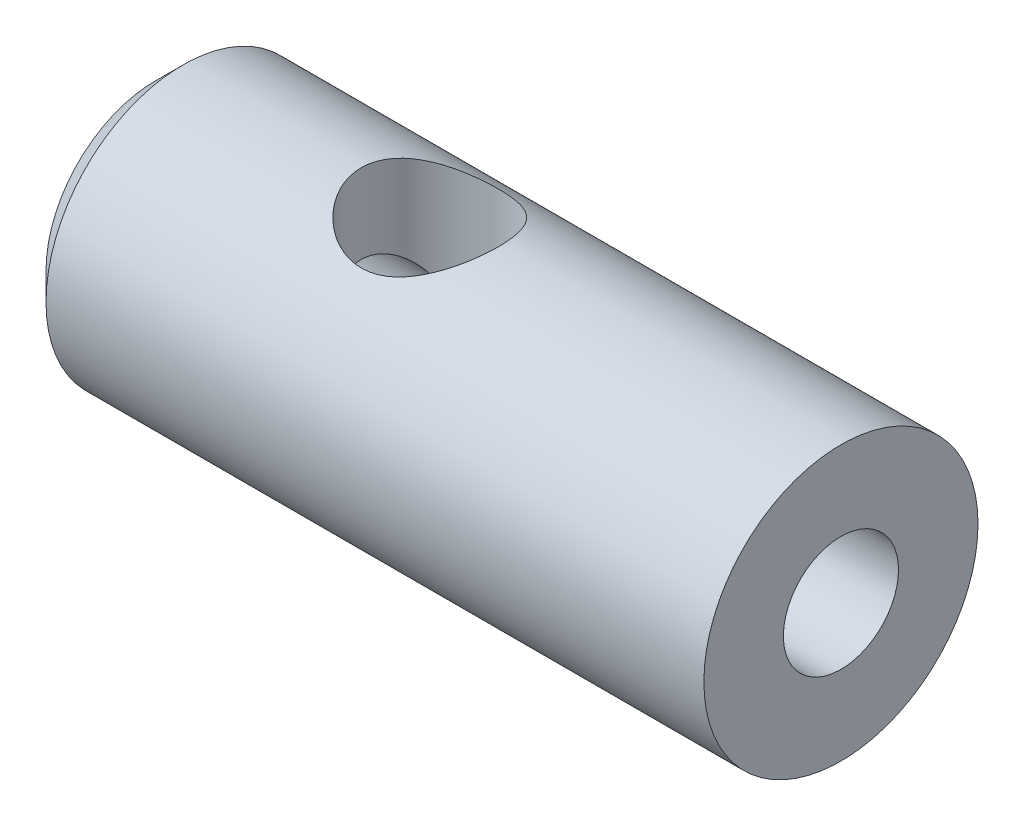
ISO-10303-21;
HEADER;
FILE_DESCRIPTION(('STEP AP214'),'2;1');
FILE_NAME('part.step','',(''),(''),'','','');
FILE_SCHEMA(('AUTOMOTIVE_DESIGN { 1 0 10303 214 1 1 1 1 }'));
ENDSEC;
DATA;
#1=APPLICATION_CONTEXT('core data for automotive mechanical design processes');
#2=APPLICATION_PROTOCOL_DEFINITION('international standard','automotive_design',2000,#1);
#3=PRODUCT_CONTEXT('',#1,'mechanical');
#4=PRODUCT('Part','Part','',(#3));
#5=PRODUCT_RELATED_PRODUCT_CATEGORY('part','',(#4));
#6=PRODUCT_DEFINITION_FORMATION('','',#4);
#7=PRODUCT_DEFINITION_CONTEXT('part definition',#1,'design');
#8=PRODUCT_DEFINITION('design','',#6,#7);
#9=PRODUCT_DEFINITION_SHAPE('','',#8);
#10=(LENGTH_UNIT() NAMED_UNIT(*) SI_UNIT(.MILLI.,.METRE.));
#11=(NAMED_UNIT(*) PLANE_ANGLE_UNIT() SI_UNIT($,.RADIAN.));
#12=(NAMED_UNIT(*) SI_UNIT($,.STERADIAN.) SOLID_ANGLE_UNIT());
#13=UNCERTAINTY_MEASURE_WITH_UNIT(LENGTH_MEASURE(1.E-05),#10,'distance_accuracy_value','');
#14=(GEOMETRIC_REPRESENTATION_CONTEXT(3) GLOBAL_UNCERTAINTY_ASSIGNED_CONTEXT((#13)) GLOBAL_UNIT_ASSIGNED_CONTEXT((#10,
#11,#12)) REPRESENTATION_CONTEXT('',''));
#15=CARTESIAN_POINT('',(0.,0.,0.));
#16=DIRECTION('',(0.,0.,1.));
#17=DIRECTION('',(1.,0.,0.));
#18=AXIS2_PLACEMENT_3D('',#15,#16,#17);
#19=CARTESIAN_POINT('',(0.,5.,0.));
#20=DIRECTION('',(-1.,0.,0.));
#21=DIRECTION('',(0.,0.,1.));
#22=AXIS2_PLACEMENT_3D('',#19,#20,#21);
#23=CYLINDRICAL_SURFACE('',#22,5.);
#24=CARTESIAN_POINT('',(1.,5.,0.));
#25=DIRECTION('',(-1.,0.,0.));
#26=DIRECTION('',(0.,0.,1.));
#27=AXIS2_PLACEMENT_3D('',#24,#25,#26);
#28=CIRCLE('',#27,5.);
#29=CARTESIAN_POINT('',(1.,5.,5.));
#30=VERTEX_POINT('',#29);
#31=EDGE_CURVE('E10',#30,#30,#28,.F.);
#32=ORIENTED_EDGE('',*,*,#31,.T.);
#33=EDGE_LOOP('',(#32));
#34=FACE_BOUND('',#33,.T.);
#35=CARTESIAN_POINT('',(25.,5.,0.));
#36=DIRECTION('',(-1.,0.,0.));
#37=DIRECTION('',(0.,0.,1.));
#38=AXIS2_PLACEMENT_3D('',#35,#36,#37);
#39=CIRCLE('',#38,5.);
#40=CARTESIAN_POINT('',(25.,5.,5.));
#41=VERTEX_POINT('',#40);
#42=EDGE_CURVE('E40',#41,#41,#39,.T.);
#43=ORIENTED_EDGE('',*,*,#42,.T.);
#44=EDGE_LOOP('',(#43));
#45=FACE_BOUND('',#44,.T.);
#46=CARTESIAN_POINT('',(10.,0.669872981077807,-2.5));
#47=CARTESIAN_POINT('',(9.86973349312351,0.669860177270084,-2.49998948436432));
#48=CARTESIAN_POINT('',(9.73929727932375,0.66390458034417,-2.48974954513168));
#49=CARTESIAN_POINT('',(9.48243102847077,0.640941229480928,-2.44930840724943));
#50=CARTESIAN_POINT('',(9.35600999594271,0.623910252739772,-2.41906526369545));
#51=CARTESIAN_POINT('',(9.11137105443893,0.581266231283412,-2.3402497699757));
#52=CARTESIAN_POINT('',(8.99311342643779,0.555698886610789,-2.29177485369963));
#53=CARTESIAN_POINT('',(8.76643943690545,0.498933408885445,-2.17816884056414));
#54=CARTESIAN_POINT('',(8.65802360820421,0.467734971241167,-2.11303684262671));
#55=CARTESIAN_POINT('',(8.44423569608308,0.400078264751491,-1.96166634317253));
#56=CARTESIAN_POINT('',(8.33985216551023,0.363398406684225,-1.87413008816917));
#57=CARTESIAN_POINT('',(8.1464790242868,0.290700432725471,-1.68313452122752));
#58=CARTESIAN_POINT('',(8.05749709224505,0.254682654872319,-1.57966731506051));
#59=CARTESIAN_POINT('',(7.89158212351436,0.184463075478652,-1.35122390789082));
#60=CARTESIAN_POINT('',(7.81586558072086,0.150547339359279,-1.22526797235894));
#61=CARTESIAN_POINT('',(7.68714786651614,0.0912310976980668,-0.960392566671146));
#62=CARTESIAN_POINT('',(7.6341323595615,0.0658252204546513,-0.821481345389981));
#63=CARTESIAN_POINT('',(7.55623834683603,0.0279884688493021,-0.545112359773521));
#64=CARTESIAN_POINT('',(7.52962618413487,0.0147629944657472,-0.408254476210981));
#65=CARTESIAN_POINT('',(7.49958470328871,-0.000189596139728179,-0.131426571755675));
#66=CARTESIAN_POINT('',(7.49614135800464,-0.00192366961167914,0.00854151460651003));
#67=CARTESIAN_POINT('',(7.51186668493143,0.00592545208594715,0.274581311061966));
#68=CARTESIAN_POINT('',(7.52909503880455,0.0145376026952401,0.400802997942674));
#69=CARTESIAN_POINT('',(7.58220210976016,0.0406438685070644,0.648284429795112));
#70=CARTESIAN_POINT('',(7.61808222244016,0.0581386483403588,0.769543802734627));
#71=CARTESIAN_POINT('',(7.70770641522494,0.100710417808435,1.00577347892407));
#72=CARTESIAN_POINT('',(7.76169078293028,0.125888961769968,1.120633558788));
#73=CARTESIAN_POINT('',(7.88565854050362,0.181558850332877,1.33994200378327));
#74=CARTESIAN_POINT('',(7.95564765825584,0.212052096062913,1.4443866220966));
#75=CARTESIAN_POINT('',(8.11723837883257,0.278890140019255,1.6504341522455));
#76=CARTESIAN_POINT('',(8.21025757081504,0.315515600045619,1.75083518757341));
#77=CARTESIAN_POINT('',(8.41147431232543,0.388641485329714,1.93526092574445));
#78=CARTESIAN_POINT('',(8.51968343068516,0.425141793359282,2.01927302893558));
#79=CARTESIAN_POINT('',(8.75662048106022,0.496396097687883,2.17376333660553));
#80=CARTESIAN_POINT('',(8.88621505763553,0.530892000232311,2.24304328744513));
#81=CARTESIAN_POINT('',(9.1573441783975,0.590613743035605,2.35829778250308));
#82=CARTESIAN_POINT('',(9.29886608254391,0.615849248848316,2.40429664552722));
#83=CARTESIAN_POINT('',(9.57803627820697,0.651384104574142,2.4679505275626));
#84=CARTESIAN_POINT('',(9.71510279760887,0.662708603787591,2.48756280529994));
#85=CARTESIAN_POINT('',(9.99100335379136,0.672052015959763,2.50379236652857));
#86=CARTESIAN_POINT('',(10.1298360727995,0.67008032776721,2.50042589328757));
#87=CARTESIAN_POINT('',(10.3891347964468,0.654141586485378,2.47259010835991));
#88=CARTESIAN_POINT('',(10.5099486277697,0.641510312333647,2.45046954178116));
#89=CARTESIAN_POINT('',(10.7459194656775,0.607649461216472,2.38924071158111));
#90=CARTESIAN_POINT('',(10.8610746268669,0.586417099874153,2.35012694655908));
#91=CARTESIAN_POINT('',(11.0885283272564,0.536594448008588,2.25411897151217));
#92=CARTESIAN_POINT('',(11.2004475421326,0.507708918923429,2.19648515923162));
#93=CARTESIAN_POINT('',(11.4136731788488,0.446097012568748,2.06571766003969));
#94=CARTESIAN_POINT('',(11.5149741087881,0.413368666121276,1.99257601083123));
#95=CARTESIAN_POINT('',(11.7174469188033,0.342800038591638,1.82209291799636));
#96=CARTESIAN_POINT('',(11.8169928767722,0.304835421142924,1.72286318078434));
#97=CARTESIAN_POINT('',(11.9985305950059,0.231644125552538,1.50851123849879));
#98=CARTESIAN_POINT('',(12.0805164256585,0.196418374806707,1.39338368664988));
#99=CARTESIAN_POINT('',(12.2264343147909,0.131465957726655,1.14633840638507));
#100=CARTESIAN_POINT('',(12.2898327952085,0.10190895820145,1.01405774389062));
#101=CARTESIAN_POINT('',(12.392844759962,0.0529161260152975,0.738805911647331));
#102=CARTESIAN_POINT('',(12.4324791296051,0.0334714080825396,0.595844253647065));
#103=CARTESIAN_POINT('',(12.4834214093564,0.00831229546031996,0.317449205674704));
#104=CARTESIAN_POINT('',(12.4969946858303,0.00150180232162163,0.182528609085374));
#105=CARTESIAN_POINT('',(12.5021081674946,-0.00105325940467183,-0.0878149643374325));
#106=CARTESIAN_POINT('',(12.4936560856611,0.00319829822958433,-0.223237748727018));
#107=CARTESIAN_POINT('',(12.4564589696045,0.0216507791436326,-0.481344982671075));
#108=CARTESIAN_POINT('',(12.4290878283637,0.0351776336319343,-0.604280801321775));
#109=CARTESIAN_POINT('',(12.3566825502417,0.0701976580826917,-0.843614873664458));
#110=CARTESIAN_POINT('',(12.3116458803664,0.0916919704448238,-0.960012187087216));
#111=CARTESIAN_POINT('',(12.2031821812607,0.141851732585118,-1.18855854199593));
#112=CARTESIAN_POINT('',(12.1390509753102,0.170784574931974,-1.30031295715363));
#113=CARTESIAN_POINT('',(11.9951058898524,0.232796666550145,-1.51193650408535));
#114=CARTESIAN_POINT('',(11.9152848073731,0.265877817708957,-1.61180014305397));
#115=CARTESIAN_POINT('',(11.7330042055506,0.336784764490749,-1.8072854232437));
#116=CARTESIAN_POINT('',(11.6290822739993,0.374755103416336,-1.90149582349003));
#117=CARTESIAN_POINT('',(11.4063847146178,0.448423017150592,-2.07165660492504));
#118=CARTESIAN_POINT('',(11.2875960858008,0.484118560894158,-2.1475908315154));
#119=CARTESIAN_POINT('',(11.0333638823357,0.55001017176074,-2.28108393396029));
#120=CARTESIAN_POINT('',(10.8975126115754,0.579996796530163,-2.3379862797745));
#121=CARTESIAN_POINT('',(10.6867773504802,0.616297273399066,-2.40494911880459));
#122=CARTESIAN_POINT('',(10.6154402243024,0.626945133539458,-2.42419582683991));
#123=CARTESIAN_POINT('',(10.4709593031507,0.644924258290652,-2.45635087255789));
#124=CARTESIAN_POINT('',(10.3978168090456,0.652257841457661,-2.46926364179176));
#125=CARTESIAN_POINT('',(10.2704990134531,0.661762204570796,-2.48591166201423));
#126=CARTESIAN_POINT('',(10.2165836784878,0.664795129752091,-2.49118864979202));
#127=CARTESIAN_POINT('',(10.1084553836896,0.668853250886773,-2.49823512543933));
#128=CARTESIAN_POINT('',(10.0542424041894,0.669878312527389,-2.50000437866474));
#129=CARTESIAN_POINT('',(10.,0.669872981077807,-2.5));
#130=B_SPLINE_CURVE_WITH_KNOTS('',3,(#46,#47,#48,#49,#50,#51,#52,#53,#54,#55,#56,#57,#58,#59,
#60,#61,#62,#63,#64,#65,#66,#67,#68,#69,#70,#71,#72,#73,#74,#75,#76,#77,#78,#79,#80,#81,#82,#83,
#84,#85,#86,#87,#88,#89,#90,#91,#92,#93,#94,#95,#96,#97,#98,#99,#100,#101,#102,#103,#104,#105,
#106,#107,#108,#109,#110,#111,#112,#113,#114,#115,#116,#117,#118,#119,#120,#121,#122,#123,#124,
#125,#126,#127,#128,#129),.UNSPECIFIED.,.T.,.F.,(4,2,2,2,2,2,2,2,2,2,2,2,2,2,2,2,2,2,2,2,2,2,2,
2,2,2,2,2,2,2,2,2,2,2,2,2,2,2,2,2,2,4),(0.,0.39058030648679,0.781982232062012,1.17132148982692,
1.56068181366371,1.98215578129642,2.40383927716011,2.85394730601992,3.30377067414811,
3.72158712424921,4.13915059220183,4.52040243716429,4.90168281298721,5.2882383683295,
5.67493248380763,6.0981797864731,6.5217512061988,6.97222104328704,7.42221935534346,
7.83655727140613,8.25060232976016,8.61935458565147,8.98822631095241,9.37418241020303,
9.76033715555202,10.1951685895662,10.6301466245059,11.076604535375,11.5226694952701,
11.927806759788,12.3328021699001,12.7111106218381,13.0894733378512,13.4840187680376,
13.8787457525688,14.3127560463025,14.7471485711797,15.195268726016,15.4189244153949,
15.6424233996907,15.8050484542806,15.9676843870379),.UNSPECIFIED.);
#131=CARTESIAN_POINT('',(10.,0.669872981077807,-2.5));
#132=VERTEX_POINT('',#131);
#133=EDGE_CURVE('E54',#132,#132,#130,.T.);
#134=ORIENTED_EDGE('',*,*,#133,.T.);
#135=EDGE_LOOP('',(#134));
#136=FACE_BOUND('',#135,.T.);
#137=CARTESIAN_POINT('',(7.5,10.,0.));
#138=CARTESIAN_POINT('',(7.50000966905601,9.99999177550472,-0.131426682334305));
#139=CARTESIAN_POINT('',(7.51042556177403,9.99476199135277,-0.263015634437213));
#140=CARTESIAN_POINT('',(7.55163182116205,9.9743541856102,-0.522301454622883));
#141=CARTESIAN_POINT('',(7.58246088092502,9.9591572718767,-0.649990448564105));
#142=CARTESIAN_POINT('',(7.66298462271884,9.92040690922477,-0.897333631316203));
#143=CARTESIAN_POINT('',(7.71260598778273,9.89688595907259,-1.01701694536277));
#144=CARTESIAN_POINT('',(7.8289265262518,9.84364443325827,-1.24618160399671));
#145=CARTESIAN_POINT('',(7.89562435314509,9.81392434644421,-1.3556637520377));
#146=CARTESIAN_POINT('',(8.04879313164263,9.74890645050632,-1.56876952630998));
#147=CARTESIAN_POINT('',(8.13621620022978,9.71337997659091,-1.67163802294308));
#148=CARTESIAN_POINT('',(8.32630369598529,9.64149925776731,-1.86194861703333));
#149=CARTESIAN_POINT('',(8.42897962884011,9.60514440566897,-1.94937895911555));
#150=CARTESIAN_POINT('',(8.65620837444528,9.53247377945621,-2.11312999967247));
#151=CARTESIAN_POINT('',(8.78184024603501,9.49637967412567,-2.18806333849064));
#152=CARTESIAN_POINT('',(9.04591833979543,9.43214946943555,-2.31542056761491));
#153=CARTESIAN_POINT('',(9.18435532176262,9.40400769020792,-2.36786053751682));
#154=CARTESIAN_POINT('',(9.46166276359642,9.36144667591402,-2.44533110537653));
#155=CARTESIAN_POINT('',(9.60001113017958,9.34630678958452,-2.47181464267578));
#156=CARTESIAN_POINT('',(9.87994709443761,9.3295472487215,-2.50106748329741));
#157=CARTESIAN_POINT('',(10.0215313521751,9.3279142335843,-2.50386022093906));
#158=CARTESIAN_POINT('',(10.2857150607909,9.33777325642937,-2.48671821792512));
#159=CARTESIAN_POINT('',(10.4085600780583,9.34771909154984,-2.46946139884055));
#160=CARTESIAN_POINT('',(10.6493047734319,9.37690571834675,-2.41734962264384));
#161=CARTESIAN_POINT('',(10.7672028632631,9.39614947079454,-2.38248905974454));
#162=CARTESIAN_POINT('',(10.9980728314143,9.44218691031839,-2.29552445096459));
#163=CARTESIAN_POINT('',(11.1108659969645,9.46914601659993,-2.24303766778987));
#164=CARTESIAN_POINT('',(11.326585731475,9.52758510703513,-2.12260421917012));
#165=CARTESIAN_POINT('',(11.4295078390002,9.55906711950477,-2.0546506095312));
#166=CARTESIAN_POINT('',(11.6363031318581,9.62782894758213,-1.89516513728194));
#167=CARTESIAN_POINT('',(11.7386421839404,9.66533775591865,-1.8017361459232));
#168=CARTESIAN_POINT('',(11.9268385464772,9.73869058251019,-1.59888894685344));
#169=CARTESIAN_POINT('',(12.0126879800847,9.77453379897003,-1.48946314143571));
#170=CARTESIAN_POINT('',(12.1692141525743,9.84254968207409,-1.25129126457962));
#171=CARTESIAN_POINT('',(12.2390011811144,9.87447460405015,-1.12188397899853));
#172=CARTESIAN_POINT('',(12.3552425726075,9.92894702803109,-0.851165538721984));
#173=CARTESIAN_POINT('',(12.4017154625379,9.95150197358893,-0.709863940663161));
#174=CARTESIAN_POINT('',(12.4661885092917,9.98310834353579,-0.431916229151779));
#175=CARTESIAN_POINT('',(12.486228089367,9.9931234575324,-0.295853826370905));
#176=CARTESIAN_POINT('',(12.5036618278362,10.0018253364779,-0.0219489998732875));
#177=CARTESIAN_POINT('',(12.5010667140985,10.0005174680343,0.11589254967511));
#178=CARTESIAN_POINT('',(12.4744832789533,9.98727980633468,0.378082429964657));
#179=CARTESIAN_POINT('',(12.4521686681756,9.97618114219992,0.502648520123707));
#180=CARTESIAN_POINT('',(12.3894048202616,9.94555428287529,0.746017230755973));
#181=CARTESIAN_POINT('',(12.3489535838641,9.92602515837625,0.864819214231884));
#182=CARTESIAN_POINT('',(12.2500038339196,9.87960628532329,1.09722152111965));
#183=CARTESIAN_POINT('',(12.1910223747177,9.85252204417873,1.21057599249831));
#184=CARTESIAN_POINT('',(12.0572311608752,9.7935993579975,1.42615340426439));
#185=CARTESIAN_POINT('',(11.9824146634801,9.76175888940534,1.52837157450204));
#186=CARTESIAN_POINT('',(11.8105989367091,9.69270553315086,1.72941922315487));
#187=CARTESIAN_POINT('',(11.7121428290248,9.65527212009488,1.82693019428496));
#188=CARTESIAN_POINT('',(11.5001871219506,9.58155978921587,2.0046408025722));
#189=CARTESIAN_POINT('',(11.3866772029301,9.54528168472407,2.08482846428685));
#190=CARTESIAN_POINT('',(11.1408908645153,9.4762798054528,2.22926978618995));
#191=CARTESIAN_POINT('',(11.0079718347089,9.44381323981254,2.29256373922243));
#192=CARTESIAN_POINT('',(10.7312248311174,9.38935180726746,2.39520706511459));
#193=CARTESIAN_POINT('',(10.587411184,9.36734345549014,2.43458729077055));
#194=CARTESIAN_POINT('',(10.3077244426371,9.33903752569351,2.48465421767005));
#195=CARTESIAN_POINT('',(10.172414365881,9.33143458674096,2.4977324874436));
#196=CARTESIAN_POINT('',(9.90138233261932,9.32913386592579,2.50172288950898));
#197=CARTESIAN_POINT('',(9.76566058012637,9.3344304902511,2.49264462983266));
#198=CARTESIAN_POINT('',(9.51129124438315,9.35594655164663,2.45481530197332));
#199=CARTESIAN_POINT('',(9.39224881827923,9.37107736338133,2.42802074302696));
#200=CARTESIAN_POINT('',(9.16047970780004,9.40927540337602,2.35793843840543));
#201=CARTESIAN_POINT('',(9.04775506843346,9.43234518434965,2.31464538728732));
#202=CARTESIAN_POINT('',(8.82343784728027,9.48571326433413,2.20953919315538));
#203=CARTESIAN_POINT('',(8.71243014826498,9.5163930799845,2.14667719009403));
#204=CARTESIAN_POINT('',(8.50181375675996,9.58088327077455,2.0053780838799));
#205=CARTESIAN_POINT('',(8.40221103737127,9.61469526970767,1.92693287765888));
#206=CARTESIAN_POINT('',(8.20464463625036,9.68655816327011,1.74550556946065));
#207=CARTESIAN_POINT('',(8.10835063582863,9.7246249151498,1.6407002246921));
#208=CARTESIAN_POINT('',(7.93434415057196,9.79694347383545,1.41539785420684));
#209=CARTESIAN_POINT('',(7.85664168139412,9.83119321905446,1.29489242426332));
#210=CARTESIAN_POINT('',(7.7219030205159,9.89245149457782,1.03978808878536));
#211=CARTESIAN_POINT('',(7.66501683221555,9.91940711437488,0.905095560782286));
#212=CARTESIAN_POINT('',(7.5978161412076,9.9517796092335,0.69632870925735));
#213=CARTESIAN_POINT('',(7.57844460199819,9.96122314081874,0.625670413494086));
#214=CARTESIAN_POINT('',(7.5459340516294,9.97717127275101,0.482623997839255));
#215=CARTESIAN_POINT('',(7.53279123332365,9.98367766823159,0.410236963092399));
#216=CARTESIAN_POINT('',(7.51526252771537,9.9923820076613,0.281518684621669));
#217=CARTESIAN_POINT('',(7.50954506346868,9.99523288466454,0.225408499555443));
#218=CARTESIAN_POINT('',(7.50191167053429,9.99904367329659,0.112875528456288));
#219=CARTESIAN_POINT('',(7.49999584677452,10.000003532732,0.0564527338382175));
#220=CARTESIAN_POINT('',(7.5,10.,0.));
#221=B_SPLINE_CURVE_WITH_KNOTS('',3,(#137,#138,#139,#140,#141,#142,#143,#144,#145,#146,#147,
#148,#149,#150,#151,#152,#153,#154,#155,#156,#157,#158,#159,#160,#161,#162,#163,#164,#165,#166,
#167,#168,#169,#170,#171,#172,#173,#174,#175,#176,#177,#178,#179,#180,#181,#182,#183,#184,#185,
#186,#187,#188,#189,#190,#191,#192,#193,#194,#195,#196,#197,#198,#199,#200,#201,#202,#203,#204,
#205,#206,#207,#208,#209,#210,#211,#212,#213,#214,#215,#216,#217,#218,#219,#220),.UNSPECIFIED.,
.T.,.F.,(4,2,2,2,2,2,2,2,2,2,2,2,2,2,2,2,2,2,2,2,2,2,2,2,2,2,2,2,2,2,2,2,2,2,2,2,2,2,2,2,2,4),
(0.,0.394060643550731,0.788870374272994,1.18215538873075,1.57540940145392,1.99245439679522,
2.40981559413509,2.85954316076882,3.30894869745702,3.73145030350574,4.15353393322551,
4.52514281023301,4.89687009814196,5.27725600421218,5.65781303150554,6.08662353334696,
6.51563836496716,6.96457555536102,7.41315542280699,7.82458226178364,8.2358141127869,
8.61517266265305,8.99457304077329,9.38482140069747,9.77523626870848,10.2039902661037,
10.6330397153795,11.0828670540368,11.53211279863,11.9382326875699,12.3441764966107,
12.7114482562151,13.0788382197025,13.4709114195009,13.8631890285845,14.303131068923,
14.7433095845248,15.1866003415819,15.407934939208,15.6291340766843,15.7983933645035,
15.9676573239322),.UNSPECIFIED.);
#222=CARTESIAN_POINT('',(7.5,10.,0.));
#223=VERTEX_POINT('',#222);
#224=EDGE_CURVE('E74',#223,#223,#221,.T.);
#225=ORIENTED_EDGE('',*,*,#224,.T.);
#226=EDGE_LOOP('',(#225));
#227=FACE_BOUND('',#226,.T.);
#228=ADVANCED_FACE('F29',(#34,#45,#136,#227),#23,.T.);
#229=CARTESIAN_POINT('',(25.,5.,0.));
#230=DIRECTION('',(1.,0.,0.));
#231=DIRECTION('',(0.,0.,-1.));
#232=AXIS2_PLACEMENT_3D('',#229,#230,#231);
#233=CYLINDRICAL_SURFACE('',#232,2.09999999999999);
#234=CARTESIAN_POINT('',(0.,5.,0.));
#235=DIRECTION('',(1.,0.,0.));
#236=DIRECTION('',(0.,0.,-1.));
#237=AXIS2_PLACEMENT_3D('',#234,#235,#236);
#238=CIRCLE('',#237,2.1);
#239=CARTESIAN_POINT('',(0.,5.,-2.1));
#240=VERTEX_POINT('',#239);
#241=EDGE_CURVE('E44',#240,#240,#238,.T.);
#242=ORIENTED_EDGE('',*,*,#241,.F.);
#243=EDGE_LOOP('',(#242));
#244=FACE_BOUND('',#243,.T.);
#245=CARTESIAN_POINT('',(8.64353400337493,5.,-2.09999999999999));
#246=CARTESIAN_POINT('',(8.6435184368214,4.92681176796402,-2.09999416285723));
#247=CARTESIAN_POINT('',(8.63747879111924,4.85350828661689,-2.0961254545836));
#248=CARTESIAN_POINT('',(8.61459225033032,4.70932587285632,-2.0810609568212));
#249=CARTESIAN_POINT('',(8.59770963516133,4.63845577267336,-2.06984094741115));
#250=CARTESIAN_POINT('',(8.54774686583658,4.47322221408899,-2.03523752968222));
#251=CARTESIAN_POINT('',(8.51089912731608,4.38067847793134,-2.00879593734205));
#252=CARTESIAN_POINT('',(8.42881463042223,4.20321694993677,-1.94527135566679));
#253=CARTESIAN_POINT('',(8.38354982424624,4.11832610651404,-1.90815255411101));
#254=CARTESIAN_POINT('',(8.30197699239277,3.97744971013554,-1.83544746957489));
#255=CARTESIAN_POINT('',(8.26650528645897,3.91979919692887,-1.80209924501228));
#256=CARTESIAN_POINT('',(8.19485610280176,3.80820537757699,-1.7303272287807));
#257=CARTESIAN_POINT('',(8.15867831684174,3.75426373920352,-1.69190117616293));
#258=CARTESIAN_POINT('',(8.05074757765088,3.59811280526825,-1.56915132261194));
#259=CARTESIAN_POINT('',(7.97944508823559,3.50133078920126,-1.47722791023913));
#260=CARTESIAN_POINT('',(7.85957212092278,3.34367905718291,-1.29529581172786));
#261=CARTESIAN_POINT('',(7.80941069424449,3.27956228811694,-1.20912687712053));
#262=CARTESIAN_POINT('',(7.71738133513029,3.16381156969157,-1.02479582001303));
#263=CARTESIAN_POINT('',(7.67549990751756,3.11215727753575,-0.926653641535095));
#264=CARTESIAN_POINT('',(7.60967750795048,3.03173398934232,-0.737922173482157));
#265=CARTESIAN_POINT('',(7.58387922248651,3.00054146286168,-0.649019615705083));
#266=CARTESIAN_POINT('',(7.54196075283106,2.95008377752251,-0.465683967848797));
#267=CARTESIAN_POINT('',(7.52583494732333,2.93081169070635,-0.371254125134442));
#268=CARTESIAN_POINT('',(7.50453252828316,2.90538626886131,-0.178975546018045));
#269=CARTESIAN_POINT('',(7.49940346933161,2.89928991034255,-0.0811138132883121));
#270=CARTESIAN_POINT('',(7.50070747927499,2.90084217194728,0.114422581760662));
#271=CARTESIAN_POINT('',(7.50714002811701,2.90849017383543,0.212097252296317));
#272=CARTESIAN_POINT('',(7.53013747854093,2.93595750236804,0.397352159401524));
#273=CARTESIAN_POINT('',(7.54596345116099,2.95488958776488,0.485160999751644));
#274=CARTESIAN_POINT('',(7.58597052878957,3.00307295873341,0.65586188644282));
#275=CARTESIAN_POINT('',(7.61015287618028,3.03232577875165,0.738753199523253));
#276=CARTESIAN_POINT('',(7.66772794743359,3.10264994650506,0.904913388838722));
#277=CARTESIAN_POINT('',(7.70171917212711,3.14450155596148,0.987640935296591));
#278=CARTESIAN_POINT('',(7.77585476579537,3.23716492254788,1.14488398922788));
#279=CARTESIAN_POINT('',(7.8160043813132,3.28798432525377,1.21939240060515));
#280=CARTESIAN_POINT('',(7.92111949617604,3.42378972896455,1.39392675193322));
#281=CARTESIAN_POINT('',(7.98868804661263,3.51340488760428,1.48884068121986));
#282=CARTESIAN_POINT('',(8.09249029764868,3.65846322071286,1.61692796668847));
#283=CARTESIAN_POINT('',(8.12755217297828,3.7086695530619,1.6572914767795));
#284=CARTESIAN_POINT('',(8.19764274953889,3.81258230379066,1.7332553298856));
#285=CARTESIAN_POINT('',(8.23267145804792,3.86628750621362,1.76885731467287));
#286=CARTESIAN_POINT('',(8.31876672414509,4.00461205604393,1.85163549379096));
#287=CARTESIAN_POINT('',(8.36921912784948,4.09141059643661,1.89585569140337));
#288=CARTESIAN_POINT('',(8.4631605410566,4.27340788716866,1.97275925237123));
#289=CARTESIAN_POINT('',(8.50666942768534,4.3685814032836,2.00547588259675));
#290=CARTESIAN_POINT('',(8.56680981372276,4.53342783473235,2.04861999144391));
#291=CARTESIAN_POINT('',(8.58753545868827,4.60057160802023,2.06284313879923));
#292=CARTESIAN_POINT('',(8.62005901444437,4.73796882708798,2.08474306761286));
#293=CARTESIAN_POINT('',(8.63187866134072,4.80821425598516,2.09243579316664));
#294=CARTESIAN_POINT('',(8.64450229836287,4.95074516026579,2.1006417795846));
#295=CARTESIAN_POINT('',(8.64521681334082,5.02304250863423,2.10109672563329));
#296=CARTESIAN_POINT('',(8.63523539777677,5.16653660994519,2.09462249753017));
#297=CARTESIAN_POINT('',(8.62452494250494,5.23773184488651,2.08768392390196));
#298=CARTESIAN_POINT('',(8.5902005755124,5.39315241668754,2.06469591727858));
#299=CARTESIAN_POINT('',(8.5641656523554,5.4765588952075,2.04690333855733));
#300=CARTESIAN_POINT('',(8.50302426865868,5.63761134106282,2.00261823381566));
#301=CARTESIAN_POINT('',(8.46788728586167,5.71523677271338,1.97609635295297));
#302=CARTESIAN_POINT('',(8.40014450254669,5.84981913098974,1.92144952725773));
#303=CARTESIAN_POINT('',(8.36843420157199,5.90780810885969,1.89470210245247));
#304=CARTESIAN_POINT('',(8.30322890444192,6.02035849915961,1.83654079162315));
#305=CARTESIAN_POINT('',(8.26973293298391,6.07491800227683,1.80512433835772));
#306=CARTESIAN_POINT('',(8.1682145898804,6.23374881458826,1.70401080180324));
#307=CARTESIAN_POINT('',(8.0991851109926,6.33312975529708,1.62746718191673));
#308=CARTESIAN_POINT('',(7.96298912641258,6.52107261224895,1.45369235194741));
#309=CARTESIAN_POINT('',(7.89594927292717,6.60919656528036,1.35588677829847));
#310=CARTESIAN_POINT('',(7.7723079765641,6.76778364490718,1.14131273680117));
#311=CARTESIAN_POINT('',(7.71567296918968,6.83830383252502,1.02460761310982));
#312=CARTESIAN_POINT('',(7.63488935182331,6.9375949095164,0.815128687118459));
#313=CARTESIAN_POINT('',(7.60617279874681,6.97247794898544,0.726999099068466));
#314=CARTESIAN_POINT('',(7.5581925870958,7.03044125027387,0.544471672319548));
#315=CARTESIAN_POINT('',(7.53892163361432,7.05353062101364,0.450078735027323));
#316=CARTESIAN_POINT('',(7.51131063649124,7.08654191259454,0.256886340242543));
#317=CARTESIAN_POINT('',(7.50302926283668,7.09639316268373,0.158066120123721));
#318=CARTESIAN_POINT('',(7.49835886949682,7.10195420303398,-0.0402552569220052));
#319=CARTESIAN_POINT('',(7.50196787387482,7.09766634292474,-0.139756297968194));
#320=CARTESIAN_POINT('',(7.51995251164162,7.07621402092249,-0.327988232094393));
#321=CARTESIAN_POINT('',(7.53342427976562,7.06013036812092,-0.416934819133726));
#322=CARTESIAN_POINT('',(7.56909085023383,7.01729014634,-0.590359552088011));
#323=CARTESIAN_POINT('',(7.59128706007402,6.99053185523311,-0.674836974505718));
#324=CARTESIAN_POINT('',(7.64460753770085,6.92567826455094,-0.842835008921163));
#325=CARTESIAN_POINT('',(7.67619948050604,6.88698363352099,-0.925972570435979));
#326=CARTESIAN_POINT('',(7.74580022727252,6.80057472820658,-1.0844784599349));
#327=CARTESIAN_POINT('',(7.78381326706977,6.75285449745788,-1.1598416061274));
#328=CARTESIAN_POINT('',(7.88388822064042,6.62487660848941,-1.33670292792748));
#329=CARTESIAN_POINT('',(7.94871759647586,6.5400147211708,-1.43331630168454));
#330=CARTESIAN_POINT('',(8.08295990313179,6.35611782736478,-1.60846221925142));
#331=CARTESIAN_POINT('',(8.1523837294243,6.25704842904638,-1.68694964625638));
#332=CARTESIAN_POINT('',(8.27761374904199,6.06353359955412,-1.81381525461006));
#333=CARTESIAN_POINT('',(8.33373589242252,5.97114389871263,-1.86504116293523));
#334=CARTESIAN_POINT('',(8.43913925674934,5.77652160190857,-1.95407725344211));
#335=CARTESIAN_POINT('',(8.4884398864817,5.67431839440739,-1.99192599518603));
#336=CARTESIAN_POINT('',(8.55576115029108,5.49963654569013,-2.04088825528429));
#337=CARTESIAN_POINT('',(8.57858131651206,5.43036340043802,-2.05670570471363));
#338=CARTESIAN_POINT('',(8.61491140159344,5.28830451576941,-2.08135142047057));
#339=CARTESIAN_POINT('',(8.62845772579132,5.21553372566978,-2.09020703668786));
#340=CARTESIAN_POINT('',(8.63857866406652,5.11842614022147,-2.09679214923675));
#341=CARTESIAN_POINT('',(8.64043029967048,5.09480069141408,-2.09799262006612));
#342=CARTESIAN_POINT('',(8.64291063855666,5.04745421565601,-2.09959758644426));
#343=CARTESIAN_POINT('',(8.64353905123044,5.02373316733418,-2.10000189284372));
#344=CARTESIAN_POINT('',(8.64353400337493,5.,-2.09999999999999));
#345=B_SPLINE_CURVE_WITH_KNOTS('',3,(#245,#246,#247,#248,#249,#250,#251,#252,#253,#254,#255,
#256,#257,#258,#259,#260,#261,#262,#263,#264,#265,#266,#267,#268,#269,#270,#271,#272,#273,#274,
#275,#276,#277,#278,#279,#280,#281,#282,#283,#284,#285,#286,#287,#288,#289,#290,#291,#292,#293,
#294,#295,#296,#297,#298,#299,#300,#301,#302,#303,#304,#305,#306,#307,#308,#309,#310,#311,#312,
#313,#314,#315,#316,#317,#318,#319,#320,#321,#322,#323,#324,#325,#326,#327,#328,#329,#330,#331,
#332,#333,#334,#335,#336,#337,#338,#339,#340,#341,#342,#343,#344),.UNSPECIFIED.,.T.,.F.,(4,2,2,
2,2,2,2,2,2,2,2,2,2,2,2,2,2,2,2,2,2,2,2,2,2,2,2,2,2,2,2,2,2,2,2,2,2,2,2,2,2,2,2,2,2,2,2,2,2,4),
(0.,0.219457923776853,0.439642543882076,0.747084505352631,1.05556992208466,1.28167154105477,
1.50787417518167,1.9593398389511,2.31371328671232,2.66750430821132,2.95934385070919,
3.25101362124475,3.54394217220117,3.83685754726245,4.10931810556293,4.38181918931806,
4.67697101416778,4.97237570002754,5.41080980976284,5.63066856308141,5.85045131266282,
6.17867149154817,6.50593453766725,6.72030143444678,6.93414343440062,7.14970749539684,
7.36554593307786,7.63156476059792,7.8984874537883,8.11211240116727,8.32585524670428,
8.7534943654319,9.19456787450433,9.63419255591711,9.9301389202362,10.2258563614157,
10.5231462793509,10.8203867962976,11.0933390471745,11.3663353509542,11.65623345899,
11.9463235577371,12.3760699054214,12.8068746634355,13.1647591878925,13.5216035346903,
13.7447843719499,13.9670839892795,14.0382319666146,14.1093968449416),.UNSPECIFIED.);
#346=CARTESIAN_POINT('',(8.64353400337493,5.,-2.09999999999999));
#347=VERTEX_POINT('',#346);
#348=EDGE_CURVE('E47',#347,#347,#345,.T.);
#349=ORIENTED_EDGE('',*,*,#348,.F.);
#350=EDGE_LOOP('',(#349));
#351=FACE_BOUND('',#350,.T.);
#352=ADVANCED_FACE('F58',(#244,#351),#233,.F.);
#353=CARTESIAN_POINT('',(25.,5.,0.));
#354=DIRECTION('',(1.,0.,0.));
#355=DIRECTION('',(0.,0.,-1.));
#356=AXIS2_PLACEMENT_3D('',#353,#354,#355);
#357=CIRCLE('',#356,2.09999999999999);
#358=CARTESIAN_POINT('',(25.,5.,-2.09999999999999));
#359=VERTEX_POINT('',#358);
#360=EDGE_CURVE('E96',#359,#359,#357,.T.);
#361=ORIENTED_EDGE('',*,*,#360,.T.);
#362=EDGE_LOOP('',(#361));
#363=FACE_BOUND('',#362,.T.);
#364=CARTESIAN_POINT('',(11.3564659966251,5.,-2.09999999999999));
#365=CARTESIAN_POINT('',(11.3564815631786,5.07318823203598,-2.09999416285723));
#366=CARTESIAN_POINT('',(11.3625212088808,5.14649171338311,-2.0961254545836));
#367=CARTESIAN_POINT('',(11.3854077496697,5.29067412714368,-2.0810609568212));
#368=CARTESIAN_POINT('',(11.4022903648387,5.36154422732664,-2.06984094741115));
#369=CARTESIAN_POINT('',(11.4522531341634,5.52677778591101,-2.03523752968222));
#370=CARTESIAN_POINT('',(11.4891008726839,5.61932152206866,-2.00879593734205));
#371=CARTESIAN_POINT('',(11.5711853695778,5.79678305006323,-1.94527135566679));
#372=CARTESIAN_POINT('',(11.6164501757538,5.88167389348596,-1.90815255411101));
#373=CARTESIAN_POINT('',(11.6980230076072,6.02255028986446,-1.83544746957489));
#374=CARTESIAN_POINT('',(11.733494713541,6.08020080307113,-1.80209924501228));
#375=CARTESIAN_POINT('',(11.8051438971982,6.19179462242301,-1.7303272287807));
#376=CARTESIAN_POINT('',(11.8413216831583,6.24573626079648,-1.69190117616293));
#377=CARTESIAN_POINT('',(11.9492524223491,6.40188719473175,-1.56915132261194));
#378=CARTESIAN_POINT('',(12.0205549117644,6.49866921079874,-1.47722791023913));
#379=CARTESIAN_POINT('',(12.1404278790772,6.65632094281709,-1.29529581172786));
#380=CARTESIAN_POINT('',(12.1905893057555,6.72043771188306,-1.20912687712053));
#381=CARTESIAN_POINT('',(12.2826186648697,6.83618843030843,-1.02479582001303));
#382=CARTESIAN_POINT('',(12.3245000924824,6.88784272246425,-0.926653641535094));
#383=CARTESIAN_POINT('',(12.3903224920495,6.96826601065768,-0.737922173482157));
#384=CARTESIAN_POINT('',(12.4161207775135,6.99945853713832,-0.649019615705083));
#385=CARTESIAN_POINT('',(12.4580392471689,7.04991622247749,-0.465683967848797));
#386=CARTESIAN_POINT('',(12.4741650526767,7.06918830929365,-0.371254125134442));
#387=CARTESIAN_POINT('',(12.4954674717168,7.09461373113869,-0.178975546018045));
#388=CARTESIAN_POINT('',(12.5005965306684,7.10071008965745,-0.0811138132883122));
#389=CARTESIAN_POINT('',(12.499292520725,7.09915782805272,0.114422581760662));
#390=CARTESIAN_POINT('',(12.492859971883,7.09150982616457,0.212097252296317));
#391=CARTESIAN_POINT('',(12.4698625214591,7.06404249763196,0.397352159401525));
#392=CARTESIAN_POINT('',(12.454036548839,7.04511041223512,0.485160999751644));
#393=CARTESIAN_POINT('',(12.4140294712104,6.99692704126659,0.65586188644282));
#394=CARTESIAN_POINT('',(12.3898471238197,6.96767422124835,0.738753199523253));
#395=CARTESIAN_POINT('',(12.3322720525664,6.89735005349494,0.904913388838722));
#396=CARTESIAN_POINT('',(12.2982808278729,6.85549844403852,0.987640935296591));
#397=CARTESIAN_POINT('',(12.2241452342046,6.76283507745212,1.14488398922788));
#398=CARTESIAN_POINT('',(12.1839956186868,6.71201567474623,1.21939240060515));
#399=CARTESIAN_POINT('',(12.078880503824,6.57621027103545,1.39392675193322));
#400=CARTESIAN_POINT('',(12.0113119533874,6.48659511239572,1.48884068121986));
#401=CARTESIAN_POINT('',(11.9075097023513,6.34153677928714,1.61692796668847));
#402=CARTESIAN_POINT('',(11.8724478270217,6.2913304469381,1.6572914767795));
#403=CARTESIAN_POINT('',(11.8023572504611,6.18741769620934,1.7332553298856));
#404=CARTESIAN_POINT('',(11.7673285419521,6.13371249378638,1.76885731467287));
#405=CARTESIAN_POINT('',(11.6812332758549,5.99538794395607,1.85163549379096));
#406=CARTESIAN_POINT('',(11.6307808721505,5.90858940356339,1.89585569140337));
#407=CARTESIAN_POINT('',(11.5368394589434,5.72659211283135,1.97275925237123));
#408=CARTESIAN_POINT('',(11.4933305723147,5.6314185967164,2.00547588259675));
#409=CARTESIAN_POINT('',(11.4331901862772,5.46657216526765,2.04861999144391));
#410=CARTESIAN_POINT('',(11.4124645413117,5.39942839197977,2.06284313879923));
#411=CARTESIAN_POINT('',(11.3799409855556,5.26203117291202,2.08474306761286));
#412=CARTESIAN_POINT('',(11.3681213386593,5.19178574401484,2.09243579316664));
#413=CARTESIAN_POINT('',(11.3554977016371,5.04925483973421,2.1006417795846));
#414=CARTESIAN_POINT('',(11.3547831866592,4.97695749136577,2.10109672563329));
#415=CARTESIAN_POINT('',(11.3647646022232,4.83346339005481,2.09462249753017));
#416=CARTESIAN_POINT('',(11.3754750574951,4.76226815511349,2.08768392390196));
#417=CARTESIAN_POINT('',(11.4097994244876,4.60684758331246,2.06469591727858));
#418=CARTESIAN_POINT('',(11.4358343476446,4.5234411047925,2.04690333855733));
#419=CARTESIAN_POINT('',(11.4969757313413,4.36238865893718,2.00261823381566));
#420=CARTESIAN_POINT('',(11.5321127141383,4.28476322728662,1.97609635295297));
#421=CARTESIAN_POINT('',(11.5998554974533,4.15018086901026,1.92144952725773));
#422=CARTESIAN_POINT('',(11.631565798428,4.0921918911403,1.89470210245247));
#423=CARTESIAN_POINT('',(11.6967710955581,3.97964150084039,1.83654079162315));
#424=CARTESIAN_POINT('',(11.7302670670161,3.92508199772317,1.80512433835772));
#425=CARTESIAN_POINT('',(11.8317854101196,3.76625118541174,1.70401080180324));
#426=CARTESIAN_POINT('',(11.9008148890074,3.66687024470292,1.62746718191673));
#427=CARTESIAN_POINT('',(12.0370108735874,3.47892738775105,1.45369235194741));
#428=CARTESIAN_POINT('',(12.1040507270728,3.39080343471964,1.35588677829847));
#429=CARTESIAN_POINT('',(12.2276920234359,3.23221635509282,1.14131273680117));
#430=CARTESIAN_POINT('',(12.2843270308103,3.16169616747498,1.02460761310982));
#431=CARTESIAN_POINT('',(12.3651106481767,3.0624050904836,0.815128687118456));
#432=CARTESIAN_POINT('',(12.3938272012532,3.02752205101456,0.726999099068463));
#433=CARTESIAN_POINT('',(12.4418074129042,2.96955874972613,0.544471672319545));
#434=CARTESIAN_POINT('',(12.4610783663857,2.94646937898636,0.45007873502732));
#435=CARTESIAN_POINT('',(12.4886893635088,2.91345808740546,0.25688634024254));
#436=CARTESIAN_POINT('',(12.4969707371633,2.90360683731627,0.158066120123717));
#437=CARTESIAN_POINT('',(12.5016411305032,2.89804579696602,-0.0402552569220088));
#438=CARTESIAN_POINT('',(12.4980321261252,2.90233365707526,-0.139756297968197));
#439=CARTESIAN_POINT('',(12.4800474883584,2.92378597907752,-0.327988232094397));
#440=CARTESIAN_POINT('',(12.4665757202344,2.93986963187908,-0.41693481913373));
#441=CARTESIAN_POINT('',(12.4309091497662,2.98270985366,-0.590359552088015));
#442=CARTESIAN_POINT('',(12.408712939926,3.00946814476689,-0.674836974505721));
#443=CARTESIAN_POINT('',(12.3553924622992,3.07432173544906,-0.842835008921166));
#444=CARTESIAN_POINT('',(12.323800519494,3.11301636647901,-0.925972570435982));
#445=CARTESIAN_POINT('',(12.2541997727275,3.19942527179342,-1.0844784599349));
#446=CARTESIAN_POINT('',(12.2161867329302,3.24714550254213,-1.1598416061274));
#447=CARTESIAN_POINT('',(12.1161117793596,3.37512339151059,-1.33670292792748));
#448=CARTESIAN_POINT('',(12.0512824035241,3.4599852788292,-1.43331630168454));
#449=CARTESIAN_POINT('',(11.9170400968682,3.64388217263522,-1.60846221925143));
#450=CARTESIAN_POINT('',(11.8476162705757,3.74295157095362,-1.68694964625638));
#451=CARTESIAN_POINT('',(11.722386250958,3.93646640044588,-1.81381525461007));
#452=CARTESIAN_POINT('',(11.6662641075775,4.02885610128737,-1.86504116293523));
#453=CARTESIAN_POINT('',(11.5608607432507,4.22347839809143,-1.95407725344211));
#454=CARTESIAN_POINT('',(11.5115601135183,4.32568160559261,-1.99192599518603));
#455=CARTESIAN_POINT('',(11.4442388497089,4.50036345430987,-2.04088825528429));
#456=CARTESIAN_POINT('',(11.4214186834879,4.56963659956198,-2.05670570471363));
#457=CARTESIAN_POINT('',(11.3850885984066,4.71169548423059,-2.08135142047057));
#458=CARTESIAN_POINT('',(11.3715422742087,4.78446627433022,-2.09020703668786));
#459=CARTESIAN_POINT('',(11.3614213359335,4.88157385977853,-2.09679214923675));
#460=CARTESIAN_POINT('',(11.3595697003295,4.90519930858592,-2.09799262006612));
#461=CARTESIAN_POINT('',(11.3570893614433,4.95254578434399,-2.09959758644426));
#462=CARTESIAN_POINT('',(11.3564609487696,4.97626683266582,-2.10000189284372));
#463=CARTESIAN_POINT('',(11.3564659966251,5.,-2.09999999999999));
#464=B_SPLINE_CURVE_WITH_KNOTS('',3,(#364,#365,#366,#367,#368,#369,#370,#371,#372,#373,#374,
#375,#376,#377,#378,#379,#380,#381,#382,#383,#384,#385,#386,#387,#388,#389,#390,#391,#392,#393,
#394,#395,#396,#397,#398,#399,#400,#401,#402,#403,#404,#405,#406,#407,#408,#409,#410,#411,#412,
#413,#414,#415,#416,#417,#418,#419,#420,#421,#422,#423,#424,#425,#426,#427,#428,#429,#430,#431,
#432,#433,#434,#435,#436,#437,#438,#439,#440,#441,#442,#443,#444,#445,#446,#447,#448,#449,#450,
#451,#452,#453,#454,#455,#456,#457,#458,#459,#460,#461,#462,#463),.UNSPECIFIED.,.T.,.F.,(4,2,2,
2,2,2,2,2,2,2,2,2,2,2,2,2,2,2,2,2,2,2,2,2,2,2,2,2,2,2,2,2,2,2,2,2,2,2,2,2,2,2,2,2,2,2,2,2,2,4),
(0.,0.219457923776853,0.439642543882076,0.747084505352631,1.05556992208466,1.28167154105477,
1.50787417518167,1.9593398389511,2.31371328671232,2.66750430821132,2.95934385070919,
3.25101362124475,3.54394217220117,3.83685754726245,4.10931810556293,4.38181918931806,
4.67697101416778,4.97237570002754,5.41080980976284,5.63066856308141,5.85045131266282,
6.17867149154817,6.50593453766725,6.72030143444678,6.93414343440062,7.14970749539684,
7.36554593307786,7.63156476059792,7.8984874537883,8.11211240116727,8.32585524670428,
8.7534943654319,9.19456787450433,9.63419255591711,9.9301389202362,10.2258563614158,
10.5231462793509,10.8203867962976,11.0933390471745,11.3663353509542,11.65623345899,
11.9463235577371,12.3760699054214,12.8068746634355,13.1647591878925,13.5216035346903,
13.7447843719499,13.9670839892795,14.0382319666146,14.1093968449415),.UNSPECIFIED.);
#465=CARTESIAN_POINT('',(11.3564659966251,5.,-2.09999999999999));
#466=VERTEX_POINT('',#465);
#467=EDGE_CURVE('E55',#466,#466,#464,.T.);
#468=ORIENTED_EDGE('',*,*,#467,.F.);
#469=EDGE_LOOP('',(#468));
#470=FACE_BOUND('',#469,.T.);
#471=ADVANCED_FACE('F86',(#363,#470),#233,.F.);
#472=CARTESIAN_POINT('',(0.,0.,0.));
#473=DIRECTION('',(-1.,0.,0.));
#474=DIRECTION('',(0.,0.,1.));
#475=AXIS2_PLACEMENT_3D('',#472,#473,#474);
#476=PLANE('',#475);
#477=CARTESIAN_POINT('',(0.,5.,0.));
#478=DIRECTION('',(-1.,0.,0.));
#479=DIRECTION('',(0.,0.,1.));
#480=AXIS2_PLACEMENT_3D('',#477,#478,#479);
#481=CIRCLE('',#480,4.);
#482=CARTESIAN_POINT('',(0.,5.,4.));
#483=VERTEX_POINT('',#482);
#484=EDGE_CURVE('E36',#483,#483,#481,.T.);
#485=ORIENTED_EDGE('',*,*,#484,.T.);
#486=EDGE_LOOP('',(#485));
#487=FACE_BOUND('',#486,.T.);
#488=ORIENTED_EDGE('',*,*,#241,.T.);
#489=EDGE_LOOP('',(#488));
#490=FACE_BOUND('',#489,.T.);
#491=ADVANCED_FACE('F83',(#487,#490),#476,.T.);
#492=CARTESIAN_POINT('',(25.,0.,0.));
#493=DIRECTION('',(1.,0.,0.));
#494=DIRECTION('',(0.,0.,-1.));
#495=AXIS2_PLACEMENT_3D('',#492,#493,#494);
#496=PLANE('',#495);
#497=ORIENTED_EDGE('',*,*,#360,.F.);
#498=EDGE_LOOP('',(#497));
#499=FACE_BOUND('',#498,.T.);
#500=ORIENTED_EDGE('',*,*,#42,.F.);
#501=EDGE_LOOP('',(#500));
#502=FACE_BOUND('',#501,.T.);
#503=ADVANCED_FACE('F64',(#499,#502),#496,.T.);
#504=CARTESIAN_POINT('',(10.,10.,0.));
#505=DIRECTION('',(0.,-1.,0.));
#506=DIRECTION('',(0.,0.,-1.));
#507=AXIS2_PLACEMENT_3D('',#504,#505,#506);
#508=CYLINDRICAL_SURFACE('',#507,2.5);
#509=ORIENTED_EDGE('',*,*,#467,.T.);
#510=EDGE_LOOP('',(#509));
#511=FACE_BOUND('',#510,.T.);
#512=ORIENTED_EDGE('',*,*,#224,.F.);
#513=EDGE_LOOP('',(#512));
#514=FACE_BOUND('',#513,.T.);
#515=ORIENTED_EDGE('',*,*,#133,.F.);
#516=EDGE_LOOP('',(#515));
#517=FACE_BOUND('',#516,.T.);
#518=ORIENTED_EDGE('',*,*,#348,.T.);
#519=EDGE_LOOP('',(#518));
#520=FACE_BOUND('',#519,.T.);
#521=ADVANCED_FACE('F61',(#511,#514,#517,#520),#508,.F.);
#522=CARTESIAN_POINT('',(0.,5.,0.));
#523=DIRECTION('',(1.,0.,0.));
#524=DIRECTION('',(0.,0.,-1.));
#525=AXIS2_PLACEMENT_3D('',#522,#523,#524);
#526=CONICAL_SURFACE('',#525,4.,0.785398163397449);
#527=ORIENTED_EDGE('',*,*,#31,.F.);
#528=EDGE_LOOP('',(#527));
#529=FACE_BOUND('',#528,.T.);
#530=ORIENTED_EDGE('',*,*,#484,.F.);
#531=EDGE_LOOP('',(#530));
#532=FACE_BOUND('',#531,.T.);
#533=ADVANCED_FACE('F31',(#529,#532),#526,.T.);
#534=CLOSED_SHELL('',(#228,#352,#471,#491,#503,#521,#533));
#535=MANIFOLD_SOLID_BREP('B2',#534);
#536=ADVANCED_BREP_SHAPE_REPRESENTATION('',(#18,#535),#14);
#537=SHAPE_DEFINITION_REPRESENTATION(#9,#536);
ENDSEC;
END-ISO-10303-21;
